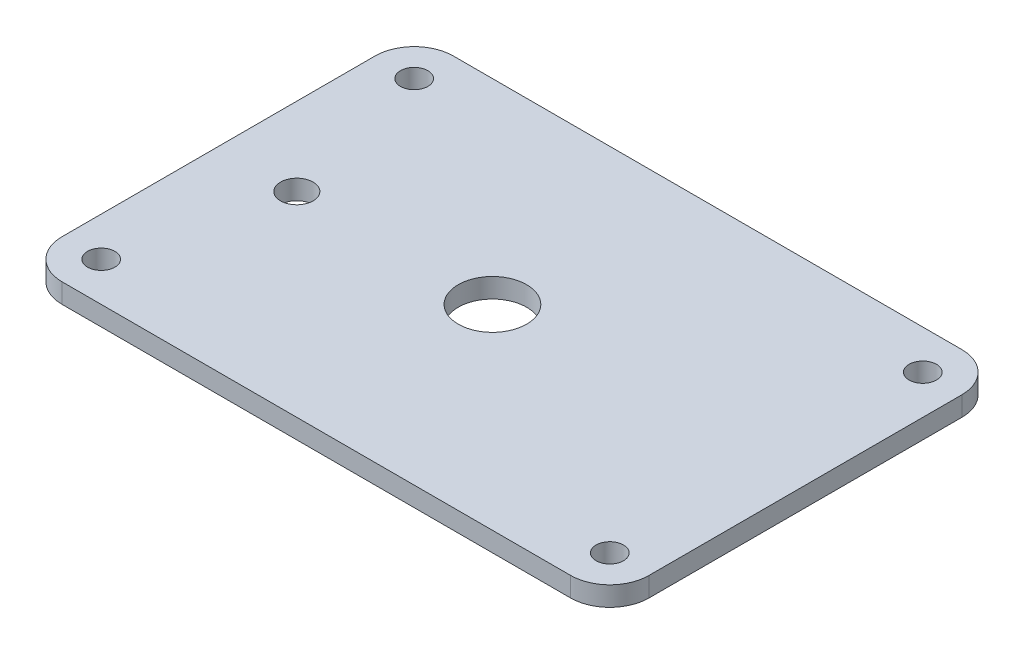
ISO-10303-21;
HEADER;
FILE_DESCRIPTION(('STEP AP214'),'2;1');
FILE_NAME('part.step','',(''),(''),'','','');
FILE_SCHEMA(('AUTOMOTIVE_DESIGN { 1 0 10303 214 1 1 1 1 }'));
ENDSEC;
DATA;
#1=APPLICATION_CONTEXT('core data for automotive mechanical design processes');
#2=APPLICATION_PROTOCOL_DEFINITION('international standard','automotive_design',2000,#1);
#3=PRODUCT_CONTEXT('',#1,'mechanical');
#4=PRODUCT('Part','Part','',(#3));
#5=PRODUCT_RELATED_PRODUCT_CATEGORY('part','',(#4));
#6=PRODUCT_DEFINITION_FORMATION('','',#4);
#7=PRODUCT_DEFINITION_CONTEXT('part definition',#1,'design');
#8=PRODUCT_DEFINITION('design','',#6,#7);
#9=PRODUCT_DEFINITION_SHAPE('','',#8);
#10=(LENGTH_UNIT() NAMED_UNIT(*) SI_UNIT(.MILLI.,.METRE.));
#11=(NAMED_UNIT(*) PLANE_ANGLE_UNIT() SI_UNIT($,.RADIAN.));
#12=(NAMED_UNIT(*) SI_UNIT($,.STERADIAN.) SOLID_ANGLE_UNIT());
#13=UNCERTAINTY_MEASURE_WITH_UNIT(LENGTH_MEASURE(1.E-05),#10,'distance_accuracy_value','');
#14=(GEOMETRIC_REPRESENTATION_CONTEXT(3) GLOBAL_UNCERTAINTY_ASSIGNED_CONTEXT((#13)) GLOBAL_UNIT_ASSIGNED_CONTEXT((#10,
#11,#12)) REPRESENTATION_CONTEXT('',''));
#15=CARTESIAN_POINT('',(0.,0.,0.));
#16=DIRECTION('',(0.,0.,1.));
#17=DIRECTION('',(1.,0.,0.));
#18=AXIS2_PLACEMENT_3D('',#15,#16,#17);
#19=CARTESIAN_POINT('',(6.,0.,-54.));
#20=DIRECTION('',(0.,-1.,0.));
#21=DIRECTION('',(0.,0.,-1.));
#22=AXIS2_PLACEMENT_3D('',#19,#20,#21);
#23=PLANE('',#22);
#24=CARTESIAN_POINT('',(6.,0.,-6.));
#25=DIRECTION('',(0.,1.,0.));
#26=DIRECTION('',(0.,0.,1.));
#27=AXIS2_PLACEMENT_3D('',#24,#25,#26);
#28=CIRCLE('',#27,2.1);
#29=CARTESIAN_POINT('',(6.,0.,-3.9));
#30=VERTEX_POINT('',#29);
#31=EDGE_CURVE('E199',#30,#30,#28,.T.);
#32=ORIENTED_EDGE('',*,*,#31,.T.);
#33=EDGE_LOOP('',(#32));
#34=FACE_BOUND('',#33,.T.);
#35=CARTESIAN_POINT('',(12.,0.,-30.));
#36=DIRECTION('',(0.,1.,0.));
#37=DIRECTION('',(0.,0.,1.));
#38=AXIS2_PLACEMENT_3D('',#35,#36,#37);
#39=CIRCLE('',#38,2.5);
#40=CARTESIAN_POINT('',(12.,0.,-27.5));
#41=VERTEX_POINT('',#40);
#42=EDGE_CURVE('E182',#41,#41,#39,.T.);
#43=ORIENTED_EDGE('',*,*,#42,.T.);
#44=EDGE_LOOP('',(#43));
#45=FACE_BOUND('',#44,.T.);
#46=CARTESIAN_POINT('',(6.,0.,-54.));
#47=DIRECTION('',(0.,1.,0.));
#48=DIRECTION('',(0.,0.,-1.));
#49=AXIS2_PLACEMENT_3D('',#46,#47,#48);
#50=CIRCLE('',#49,6.);
#51=CARTESIAN_POINT('',(6.00000000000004,0.,-60.));
#52=VERTEX_POINT('',#51);
#53=CARTESIAN_POINT('',(0.,0.,-54.));
#54=VERTEX_POINT('',#53);
#55=EDGE_CURVE('E128',#52,#54,#50,.T.);
#56=ORIENTED_EDGE('',*,*,#55,.F.);
#57=DIRECTION('',(-1.,0.,0.));
#58=VECTOR('',#57,1.);
#59=CARTESIAN_POINT('',(6.00000000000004,0.,-60.));
#60=LINE('',#59,#58);
#61=CARTESIAN_POINT('',(83.9999999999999,0.,-60.));
#62=VERTEX_POINT('',#61);
#63=EDGE_CURVE('E82',#62,#52,#60,.T.);
#64=ORIENTED_EDGE('',*,*,#63,.F.);
#65=CARTESIAN_POINT('',(84.,0.,-54.));
#66=DIRECTION('',(0.,1.,0.));
#67=DIRECTION('',(0.,0.,1.));
#68=AXIS2_PLACEMENT_3D('',#65,#66,#67);
#69=CIRCLE('',#68,6.);
#70=CARTESIAN_POINT('',(90.,0.,-54.));
#71=VERTEX_POINT('',#70);
#72=EDGE_CURVE('E76',#71,#62,#69,.T.);
#73=ORIENTED_EDGE('',*,*,#72,.F.);
#74=DIRECTION('',(0.,0.,-1.));
#75=VECTOR('',#74,1.);
#76=CARTESIAN_POINT('',(90.,0.,-6.00000000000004));
#77=LINE('',#76,#75);
#78=CARTESIAN_POINT('',(90.,0.,-6.00000000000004));
#79=VERTEX_POINT('',#78);
#80=EDGE_CURVE('E118',#79,#71,#77,.T.);
#81=ORIENTED_EDGE('',*,*,#80,.F.);
#82=CARTESIAN_POINT('',(84.,0.,-6.));
#83=DIRECTION('',(0.,1.,0.));
#84=DIRECTION('',(0.,0.,1.));
#85=AXIS2_PLACEMENT_3D('',#82,#83,#84);
#86=CIRCLE('',#85,6.);
#87=CARTESIAN_POINT('',(83.9999999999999,0.,0.));
#88=VERTEX_POINT('',#87);
#89=EDGE_CURVE('E138',#88,#79,#86,.T.);
#90=ORIENTED_EDGE('',*,*,#89,.F.);
#91=DIRECTION('',(1.,0.,0.));
#92=VECTOR('',#91,1.);
#93=CARTESIAN_POINT('',(6.00000000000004,0.,0.));
#94=LINE('',#93,#92);
#95=CARTESIAN_POINT('',(6.00000000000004,0.,0.));
#96=VERTEX_POINT('',#95);
#97=EDGE_CURVE('E136',#96,#88,#94,.T.);
#98=ORIENTED_EDGE('',*,*,#97,.F.);
#99=CARTESIAN_POINT('',(6.,0.,-6.));
#100=DIRECTION('',(0.,1.,0.));
#101=DIRECTION('',(0.,0.,-1.));
#102=AXIS2_PLACEMENT_3D('',#99,#100,#101);
#103=CIRCLE('',#102,6.);
#104=CARTESIAN_POINT('',(0.,0.,-6.00000000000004));
#105=VERTEX_POINT('',#104);
#106=EDGE_CURVE('E134',#105,#96,#103,.T.);
#107=ORIENTED_EDGE('',*,*,#106,.F.);
#108=DIRECTION('',(0.,0.,1.));
#109=VECTOR('',#108,1.);
#110=CARTESIAN_POINT('',(0.,0.,-6.00000000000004));
#111=LINE('',#110,#109);
#112=EDGE_CURVE('E131',#54,#105,#111,.T.);
#113=ORIENTED_EDGE('',*,*,#112,.F.);
#114=EDGE_LOOP('',(#56,#64,#73,#81,#90,#98,#107,#113));
#115=FACE_BOUND('',#114,.T.);
#116=CARTESIAN_POINT('',(42.,0.,-30.));
#117=DIRECTION('',(0.,1.,0.));
#118=DIRECTION('',(0.,0.,1.));
#119=AXIS2_PLACEMENT_3D('',#116,#117,#118);
#120=CIRCLE('',#119,5.25);
#121=CARTESIAN_POINT('',(42.,0.,-24.75));
#122=VERTEX_POINT('',#121);
#123=EDGE_CURVE('E176',#122,#122,#120,.T.);
#124=ORIENTED_EDGE('',*,*,#123,.T.);
#125=EDGE_LOOP('',(#124));
#126=FACE_BOUND('',#125,.T.);
#127=CARTESIAN_POINT('',(84.,0.,-54.));
#128=DIRECTION('',(0.,1.,0.));
#129=DIRECTION('',(0.,0.,1.));
#130=AXIS2_PLACEMENT_3D('',#127,#128,#129);
#131=CIRCLE('',#130,2.09999999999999);
#132=CARTESIAN_POINT('',(84.,0.,-51.9));
#133=VERTEX_POINT('',#132);
#134=EDGE_CURVE('E185',#133,#133,#131,.T.);
#135=ORIENTED_EDGE('',*,*,#134,.T.);
#136=EDGE_LOOP('',(#135));
#137=FACE_BOUND('',#136,.T.);
#138=CARTESIAN_POINT('',(84.,0.,-6.));
#139=DIRECTION('',(0.,1.,0.));
#140=DIRECTION('',(0.,0.,1.));
#141=AXIS2_PLACEMENT_3D('',#138,#139,#140);
#142=CIRCLE('',#141,2.09999999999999);
#143=CARTESIAN_POINT('',(84.,0.,-3.90000000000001));
#144=VERTEX_POINT('',#143);
#145=EDGE_CURVE('E193',#144,#144,#142,.T.);
#146=ORIENTED_EDGE('',*,*,#145,.T.);
#147=EDGE_LOOP('',(#146));
#148=FACE_BOUND('',#147,.T.);
#149=CARTESIAN_POINT('',(6.,0.,-54.));
#150=DIRECTION('',(0.,1.,0.));
#151=DIRECTION('',(0.,0.,1.));
#152=AXIS2_PLACEMENT_3D('',#149,#150,#151);
#153=CIRCLE('',#152,2.1);
#154=CARTESIAN_POINT('',(6.,0.,-51.9));
#155=VERTEX_POINT('',#154);
#156=EDGE_CURVE('E205',#155,#155,#153,.T.);
#157=ORIENTED_EDGE('',*,*,#156,.T.);
#158=EDGE_LOOP('',(#157));
#159=FACE_BOUND('',#158,.T.);
#160=ADVANCED_FACE('F30',(#34,#45,#115,#126,#137,#148,#159),#23,.T.);
#161=CARTESIAN_POINT('',(6.,3.,-54.));
#162=DIRECTION('',(0.,-1.,0.));
#163=DIRECTION('',(0.,0.,-1.));
#164=AXIS2_PLACEMENT_3D('',#161,#162,#163);
#165=PLANE('',#164);
#166=CARTESIAN_POINT('',(6.,3.,-6.));
#167=DIRECTION('',(0.,1.,0.));
#168=DIRECTION('',(0.,0.,1.));
#169=AXIS2_PLACEMENT_3D('',#166,#167,#168);
#170=CIRCLE('',#169,2.09999999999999);
#171=CARTESIAN_POINT('',(6.,3.,-3.90000000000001));
#172=VERTEX_POINT('',#171);
#173=EDGE_CURVE('E202',#172,#172,#170,.T.);
#174=ORIENTED_EDGE('',*,*,#173,.F.);
#175=EDGE_LOOP('',(#174));
#176=FACE_BOUND('',#175,.T.);
#177=CARTESIAN_POINT('',(84.,3.,-6.));
#178=DIRECTION('',(0.,1.,0.));
#179=DIRECTION('',(0.,0.,1.));
#180=AXIS2_PLACEMENT_3D('',#177,#178,#179);
#181=CIRCLE('',#180,2.09999999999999);
#182=CARTESIAN_POINT('',(84.,3.,-3.90000000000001));
#183=VERTEX_POINT('',#182);
#184=EDGE_CURVE('E196',#183,#183,#181,.T.);
#185=ORIENTED_EDGE('',*,*,#184,.F.);
#186=EDGE_LOOP('',(#185));
#187=FACE_BOUND('',#186,.T.);
#188=CARTESIAN_POINT('',(12.,3.,-30.));
#189=DIRECTION('',(0.,1.,0.));
#190=DIRECTION('',(0.,0.,1.));
#191=AXIS2_PLACEMENT_3D('',#188,#189,#190);
#192=CIRCLE('',#191,2.5);
#193=CARTESIAN_POINT('',(12.,3.,-27.5));
#194=VERTEX_POINT('',#193);
#195=EDGE_CURVE('E179',#194,#194,#192,.T.);
#196=ORIENTED_EDGE('',*,*,#195,.F.);
#197=EDGE_LOOP('',(#196));
#198=FACE_BOUND('',#197,.T.);
#199=CARTESIAN_POINT('',(6.,3.,-54.));
#200=DIRECTION('',(0.,1.,0.));
#201=DIRECTION('',(0.,0.,-1.));
#202=AXIS2_PLACEMENT_3D('',#199,#200,#201);
#203=CIRCLE('',#202,6.);
#204=CARTESIAN_POINT('',(6.00000000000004,3.,-60.));
#205=VERTEX_POINT('',#204);
#206=CARTESIAN_POINT('',(0.,3.,-54.));
#207=VERTEX_POINT('',#206);
#208=EDGE_CURVE('E143',#205,#207,#203,.T.);
#209=ORIENTED_EDGE('',*,*,#208,.T.);
#210=DIRECTION('',(0.,0.,1.));
#211=VECTOR('',#210,1.);
#212=CARTESIAN_POINT('',(0.,3.,-6.00000000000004));
#213=LINE('',#212,#211);
#214=CARTESIAN_POINT('',(0.,3.,-6.00000000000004));
#215=VERTEX_POINT('',#214);
#216=EDGE_CURVE('E90',#207,#215,#213,.T.);
#217=ORIENTED_EDGE('',*,*,#216,.T.);
#218=CARTESIAN_POINT('',(6.,3.,-6.));
#219=DIRECTION('',(0.,1.,0.));
#220=DIRECTION('',(0.,0.,-1.));
#221=AXIS2_PLACEMENT_3D('',#218,#219,#220);
#222=CIRCLE('',#221,6.);
#223=CARTESIAN_POINT('',(6.00000000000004,3.,0.));
#224=VERTEX_POINT('',#223);
#225=EDGE_CURVE('E158',#215,#224,#222,.T.);
#226=ORIENTED_EDGE('',*,*,#225,.T.);
#227=DIRECTION('',(1.,0.,0.));
#228=VECTOR('',#227,1.);
#229=CARTESIAN_POINT('',(6.00000000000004,3.,0.));
#230=LINE('',#229,#228);
#231=CARTESIAN_POINT('',(83.9999999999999,3.,0.));
#232=VERTEX_POINT('',#231);
#233=EDGE_CURVE('E170',#224,#232,#230,.T.);
#234=ORIENTED_EDGE('',*,*,#233,.T.);
#235=CARTESIAN_POINT('',(84.,3.,-6.));
#236=DIRECTION('',(0.,1.,0.));
#237=DIRECTION('',(0.,0.,1.));
#238=AXIS2_PLACEMENT_3D('',#235,#236,#237);
#239=CIRCLE('',#238,6.);
#240=CARTESIAN_POINT('',(90.,3.,-6.00000000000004));
#241=VERTEX_POINT('',#240);
#242=EDGE_CURVE('E110',#232,#241,#239,.T.);
#243=ORIENTED_EDGE('',*,*,#242,.T.);
#244=DIRECTION('',(0.,0.,-1.));
#245=VECTOR('',#244,1.);
#246=CARTESIAN_POINT('',(90.,3.,-6.00000000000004));
#247=LINE('',#246,#245);
#248=CARTESIAN_POINT('',(90.,3.,-54.));
#249=VERTEX_POINT('',#248);
#250=EDGE_CURVE('E103',#241,#249,#247,.T.);
#251=ORIENTED_EDGE('',*,*,#250,.T.);
#252=CARTESIAN_POINT('',(84.,3.,-54.));
#253=DIRECTION('',(0.,1.,0.));
#254=DIRECTION('',(0.,0.,1.));
#255=AXIS2_PLACEMENT_3D('',#252,#253,#254);
#256=CIRCLE('',#255,6.);
#257=CARTESIAN_POINT('',(83.9999999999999,3.,-60.));
#258=VERTEX_POINT('',#257);
#259=EDGE_CURVE('E108',#249,#258,#256,.T.);
#260=ORIENTED_EDGE('',*,*,#259,.T.);
#261=DIRECTION('',(-1.,0.,0.));
#262=VECTOR('',#261,1.);
#263=CARTESIAN_POINT('',(6.00000000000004,3.,-60.));
#264=LINE('',#263,#262);
#265=EDGE_CURVE('E47',#258,#205,#264,.T.);
#266=ORIENTED_EDGE('',*,*,#265,.T.);
#267=EDGE_LOOP('',(#209,#217,#226,#234,#243,#251,#260,#266));
#268=FACE_BOUND('',#267,.T.);
#269=CARTESIAN_POINT('',(42.,3.,-30.));
#270=DIRECTION('',(0.,1.,0.));
#271=DIRECTION('',(0.,0.,1.));
#272=AXIS2_PLACEMENT_3D('',#269,#270,#271);
#273=CIRCLE('',#272,5.25);
#274=CARTESIAN_POINT('',(42.,3.,-24.75));
#275=VERTEX_POINT('',#274);
#276=EDGE_CURVE('E132',#275,#275,#273,.T.);
#277=ORIENTED_EDGE('',*,*,#276,.F.);
#278=EDGE_LOOP('',(#277));
#279=FACE_BOUND('',#278,.T.);
#280=CARTESIAN_POINT('',(84.,3.,-54.));
#281=DIRECTION('',(0.,1.,0.));
#282=DIRECTION('',(0.,0.,1.));
#283=AXIS2_PLACEMENT_3D('',#280,#281,#282);
#284=CIRCLE('',#283,2.09999999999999);
#285=CARTESIAN_POINT('',(84.,3.,-51.9));
#286=VERTEX_POINT('',#285);
#287=EDGE_CURVE('E190',#286,#286,#284,.T.);
#288=ORIENTED_EDGE('',*,*,#287,.F.);
#289=EDGE_LOOP('',(#288));
#290=FACE_BOUND('',#289,.T.);
#291=CARTESIAN_POINT('',(6.,3.,-54.));
#292=DIRECTION('',(0.,1.,0.));
#293=DIRECTION('',(0.,0.,1.));
#294=AXIS2_PLACEMENT_3D('',#291,#292,#293);
#295=CIRCLE('',#294,2.09999999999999);
#296=CARTESIAN_POINT('',(6.,3.,-51.9));
#297=VERTEX_POINT('',#296);
#298=EDGE_CURVE('E208',#297,#297,#295,.T.);
#299=ORIENTED_EDGE('',*,*,#298,.F.);
#300=EDGE_LOOP('',(#299));
#301=FACE_BOUND('',#300,.T.);
#302=ADVANCED_FACE('F105',(#176,#187,#198,#268,#279,#290,#301),#165,.F.);
#303=CARTESIAN_POINT('',(6.,3.,-54.));
#304=DIRECTION('',(0.,-1.,0.));
#305=DIRECTION('',(0.,0.,-1.));
#306=AXIS2_PLACEMENT_3D('',#303,#304,#305);
#307=CYLINDRICAL_SURFACE('',#306,6.);
#308=ORIENTED_EDGE('',*,*,#55,.T.);
#309=DIRECTION('',(0.,-1.,0.));
#310=VECTOR('',#309,1.);
#311=CARTESIAN_POINT('',(0.,3.,-54.));
#312=LINE('',#311,#310);
#313=EDGE_CURVE('E11',#207,#54,#312,.T.);
#314=ORIENTED_EDGE('',*,*,#313,.F.);
#315=ORIENTED_EDGE('',*,*,#208,.F.);
#316=DIRECTION('',(0.,-1.,0.));
#317=VECTOR('',#316,1.);
#318=CARTESIAN_POINT('',(6.00000000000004,3.,-60.));
#319=LINE('',#318,#317);
#320=EDGE_CURVE('E124',#205,#52,#319,.T.);
#321=ORIENTED_EDGE('',*,*,#320,.T.);
#322=EDGE_LOOP('',(#308,#314,#315,#321));
#323=FACE_BOUND('',#322,.T.);
#324=ADVANCED_FACE('F32',(#323),#307,.T.);
#325=CARTESIAN_POINT('',(0.,3.,-6.00000000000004));
#326=DIRECTION('',(1.,0.,0.));
#327=DIRECTION('',(0.,0.,-1.));
#328=AXIS2_PLACEMENT_3D('',#325,#326,#327);
#329=PLANE('',#328);
#330=ORIENTED_EDGE('',*,*,#112,.T.);
#331=DIRECTION('',(0.,-1.,0.));
#332=VECTOR('',#331,1.);
#333=CARTESIAN_POINT('',(0.,3.,-6.00000000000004));
#334=LINE('',#333,#332);
#335=EDGE_CURVE('E39',#215,#105,#334,.T.);
#336=ORIENTED_EDGE('',*,*,#335,.F.);
#337=ORIENTED_EDGE('',*,*,#216,.F.);
#338=ORIENTED_EDGE('',*,*,#313,.T.);
#339=EDGE_LOOP('',(#330,#336,#337,#338));
#340=FACE_BOUND('',#339,.T.);
#341=ADVANCED_FACE('F221',(#340),#329,.F.);
#342=CARTESIAN_POINT('',(6.,3.,-6.));
#343=DIRECTION('',(0.,-1.,0.));
#344=DIRECTION('',(0.,0.,-1.));
#345=AXIS2_PLACEMENT_3D('',#342,#343,#344);
#346=CYLINDRICAL_SURFACE('',#345,6.);
#347=ORIENTED_EDGE('',*,*,#106,.T.);
#348=DIRECTION('',(0.,-1.,0.));
#349=VECTOR('',#348,1.);
#350=CARTESIAN_POINT('',(6.00000000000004,3.,0.));
#351=LINE('',#350,#349);
#352=EDGE_CURVE('E150',#224,#96,#351,.T.);
#353=ORIENTED_EDGE('',*,*,#352,.F.);
#354=ORIENTED_EDGE('',*,*,#225,.F.);
#355=ORIENTED_EDGE('',*,*,#335,.T.);
#356=EDGE_LOOP('',(#347,#353,#354,#355));
#357=FACE_BOUND('',#356,.T.);
#358=ADVANCED_FACE('F156',(#357),#346,.T.);
#359=CARTESIAN_POINT('',(6.00000000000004,3.,0.));
#360=DIRECTION('',(0.,0.,-1.));
#361=DIRECTION('',(-1.,0.,0.));
#362=AXIS2_PLACEMENT_3D('',#359,#360,#361);
#363=PLANE('',#362);
#364=ORIENTED_EDGE('',*,*,#97,.T.);
#365=DIRECTION('',(0.,-1.,0.));
#366=VECTOR('',#365,1.);
#367=CARTESIAN_POINT('',(83.9999999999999,3.,0.));
#368=LINE('',#367,#366);
#369=EDGE_CURVE('E147',#232,#88,#368,.T.);
#370=ORIENTED_EDGE('',*,*,#369,.F.);
#371=ORIENTED_EDGE('',*,*,#233,.F.);
#372=ORIENTED_EDGE('',*,*,#352,.T.);
#373=EDGE_LOOP('',(#364,#370,#371,#372));
#374=FACE_BOUND('',#373,.T.);
#375=ADVANCED_FACE('F166',(#374),#363,.F.);
#376=CARTESIAN_POINT('',(84.,3.,-6.));
#377=DIRECTION('',(0.,-1.,0.));
#378=DIRECTION('',(0.,0.,-1.));
#379=AXIS2_PLACEMENT_3D('',#376,#377,#378);
#380=CYLINDRICAL_SURFACE('',#379,6.);
#381=ORIENTED_EDGE('',*,*,#89,.T.);
#382=DIRECTION('',(0.,-1.,0.));
#383=VECTOR('',#382,1.);
#384=CARTESIAN_POINT('',(90.,3.,-6.00000000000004));
#385=LINE('',#384,#383);
#386=EDGE_CURVE('E119',#241,#79,#385,.T.);
#387=ORIENTED_EDGE('',*,*,#386,.F.);
#388=ORIENTED_EDGE('',*,*,#242,.F.);
#389=ORIENTED_EDGE('',*,*,#369,.T.);
#390=EDGE_LOOP('',(#381,#387,#388,#389));
#391=FACE_BOUND('',#390,.T.);
#392=ADVANCED_FACE('F169',(#391),#380,.T.);
#393=CARTESIAN_POINT('',(90.,3.,-6.00000000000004));
#394=DIRECTION('',(-1.,0.,0.));
#395=DIRECTION('',(0.,0.,1.));
#396=AXIS2_PLACEMENT_3D('',#393,#394,#395);
#397=PLANE('',#396);
#398=ORIENTED_EDGE('',*,*,#80,.T.);
#399=DIRECTION('',(0.,-1.,0.));
#400=VECTOR('',#399,1.);
#401=CARTESIAN_POINT('',(90.,3.,-54.));
#402=LINE('',#401,#400);
#403=EDGE_CURVE('E115',#249,#71,#402,.T.);
#404=ORIENTED_EDGE('',*,*,#403,.F.);
#405=ORIENTED_EDGE('',*,*,#250,.F.);
#406=ORIENTED_EDGE('',*,*,#386,.T.);
#407=EDGE_LOOP('',(#398,#404,#405,#406));
#408=FACE_BOUND('',#407,.T.);
#409=ADVANCED_FACE('F116',(#408),#397,.F.);
#410=CARTESIAN_POINT('',(84.,3.,-54.));
#411=DIRECTION('',(0.,-1.,0.));
#412=DIRECTION('',(0.,0.,-1.));
#413=AXIS2_PLACEMENT_3D('',#410,#411,#412);
#414=CYLINDRICAL_SURFACE('',#413,6.);
#415=ORIENTED_EDGE('',*,*,#72,.T.);
#416=DIRECTION('',(0.,-1.,0.));
#417=VECTOR('',#416,1.);
#418=CARTESIAN_POINT('',(83.9999999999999,3.,-60.));
#419=LINE('',#418,#417);
#420=EDGE_CURVE('E120',#258,#62,#419,.T.);
#421=ORIENTED_EDGE('',*,*,#420,.F.);
#422=ORIENTED_EDGE('',*,*,#259,.F.);
#423=ORIENTED_EDGE('',*,*,#403,.T.);
#424=EDGE_LOOP('',(#415,#421,#422,#423));
#425=FACE_BOUND('',#424,.T.);
#426=ADVANCED_FACE('F122',(#425),#414,.T.);
#427=CARTESIAN_POINT('',(6.00000000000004,3.,-60.));
#428=DIRECTION('',(0.,0.,1.));
#429=DIRECTION('',(1.,0.,0.));
#430=AXIS2_PLACEMENT_3D('',#427,#428,#429);
#431=PLANE('',#430);
#432=ORIENTED_EDGE('',*,*,#63,.T.);
#433=ORIENTED_EDGE('',*,*,#320,.F.);
#434=ORIENTED_EDGE('',*,*,#265,.F.);
#435=ORIENTED_EDGE('',*,*,#420,.T.);
#436=EDGE_LOOP('',(#432,#433,#434,#435));
#437=FACE_BOUND('',#436,.T.);
#438=ADVANCED_FACE('F231',(#437),#431,.F.);
#439=CARTESIAN_POINT('',(42.,3.,-30.));
#440=DIRECTION('',(0.,-1.,0.));
#441=DIRECTION('',(0.,0.,-1.));
#442=AXIS2_PLACEMENT_3D('',#439,#440,#441);
#443=CYLINDRICAL_SURFACE('',#442,5.25);
#444=ORIENTED_EDGE('',*,*,#276,.T.);
#445=EDGE_LOOP('',(#444));
#446=FACE_BOUND('',#445,.T.);
#447=ORIENTED_EDGE('',*,*,#123,.F.);
#448=EDGE_LOOP('',(#447));
#449=FACE_BOUND('',#448,.T.);
#450=ADVANCED_FACE('F228',(#446,#449),#443,.F.);
#451=CARTESIAN_POINT('',(12.,3.,-30.));
#452=DIRECTION('',(0.,-1.,0.));
#453=DIRECTION('',(0.,0.,-1.));
#454=AXIS2_PLACEMENT_3D('',#451,#452,#453);
#455=CYLINDRICAL_SURFACE('',#454,2.5);
#456=ORIENTED_EDGE('',*,*,#195,.T.);
#457=EDGE_LOOP('',(#456));
#458=FACE_BOUND('',#457,.T.);
#459=ORIENTED_EDGE('',*,*,#42,.F.);
#460=EDGE_LOOP('',(#459));
#461=FACE_BOUND('',#460,.T.);
#462=ADVANCED_FACE('F280',(#458,#461),#455,.F.);
#463=CARTESIAN_POINT('',(84.,3.,-54.));
#464=DIRECTION('',(0.,1.,0.));
#465=DIRECTION('',(0.,0.,1.));
#466=AXIS2_PLACEMENT_3D('',#463,#464,#465);
#467=CYLINDRICAL_SURFACE('',#466,2.09999999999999);
#468=ORIENTED_EDGE('',*,*,#134,.F.);
#469=EDGE_LOOP('',(#468));
#470=FACE_BOUND('',#469,.T.);
#471=ORIENTED_EDGE('',*,*,#287,.T.);
#472=EDGE_LOOP('',(#471));
#473=FACE_BOUND('',#472,.T.);
#474=ADVANCED_FACE('F287',(#470,#473),#467,.F.);
#475=CARTESIAN_POINT('',(84.,3.,-6.));
#476=DIRECTION('',(0.,1.,0.));
#477=DIRECTION('',(0.,0.,1.));
#478=AXIS2_PLACEMENT_3D('',#475,#476,#477);
#479=CYLINDRICAL_SURFACE('',#478,2.09999999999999);
#480=ORIENTED_EDGE('',*,*,#145,.F.);
#481=EDGE_LOOP('',(#480));
#482=FACE_BOUND('',#481,.T.);
#483=ORIENTED_EDGE('',*,*,#184,.T.);
#484=EDGE_LOOP('',(#483));
#485=FACE_BOUND('',#484,.T.);
#486=ADVANCED_FACE('F295',(#482,#485),#479,.F.);
#487=CARTESIAN_POINT('',(6.,3.,-6.));
#488=DIRECTION('',(0.,1.,0.));
#489=DIRECTION('',(0.,0.,1.));
#490=AXIS2_PLACEMENT_3D('',#487,#488,#489);
#491=CYLINDRICAL_SURFACE('',#490,2.09999999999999);
#492=ORIENTED_EDGE('',*,*,#31,.F.);
#493=EDGE_LOOP('',(#492));
#494=FACE_BOUND('',#493,.T.);
#495=ORIENTED_EDGE('',*,*,#173,.T.);
#496=EDGE_LOOP('',(#495));
#497=FACE_BOUND('',#496,.T.);
#498=ADVANCED_FACE('F303',(#494,#497),#491,.F.);
#499=CARTESIAN_POINT('',(6.,3.,-54.));
#500=DIRECTION('',(0.,1.,0.));
#501=DIRECTION('',(0.,0.,1.));
#502=AXIS2_PLACEMENT_3D('',#499,#500,#501);
#503=CYLINDRICAL_SURFACE('',#502,2.09999999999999);
#504=ORIENTED_EDGE('',*,*,#156,.F.);
#505=EDGE_LOOP('',(#504));
#506=FACE_BOUND('',#505,.T.);
#507=ORIENTED_EDGE('',*,*,#298,.T.);
#508=EDGE_LOOP('',(#507));
#509=FACE_BOUND('',#508,.T.);
#510=ADVANCED_FACE('F212',(#506,#509),#503,.F.);
#511=CLOSED_SHELL('',(#160,#302,#324,#341,#358,#375,#392,#409,#426,#438,#450,#462,#474,#486,
#498,#510));
#512=MANIFOLD_SOLID_BREP('B2',#511);
#513=ADVANCED_BREP_SHAPE_REPRESENTATION('',(#18,#512),#14);
#514=SHAPE_DEFINITION_REPRESENTATION(#9,#513);
ENDSEC;
END-ISO-10303-21;
